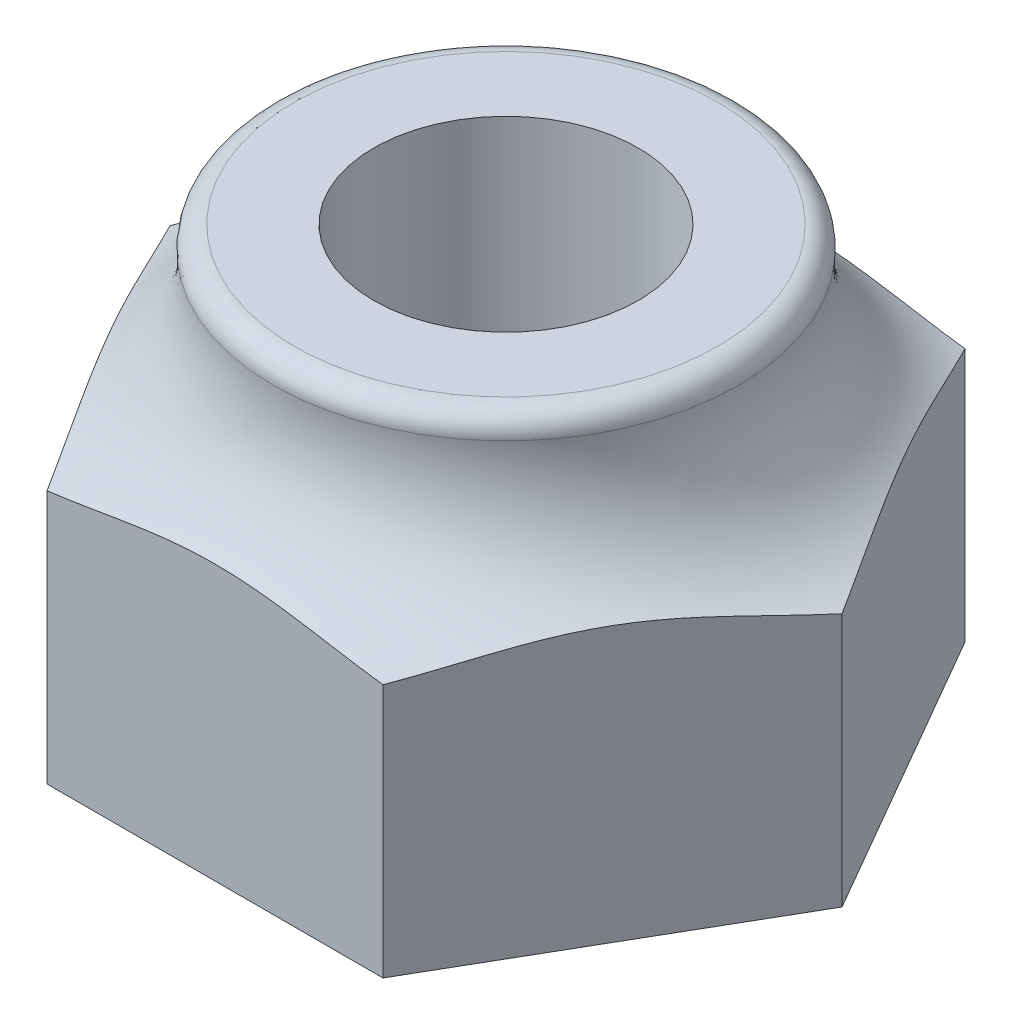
from build123d import *

# Parameters (mm, degrees)
AUFSATZ_LINEAR_AUSTRAGEN1_DEPTH = 4
F_1_0_1_DURCHMESSER_BOHRUNG1_D  = 2.5


with BuildPart() as part:
    # Skizze1 → Aufsatz-Linear austragen1 (new body)
    with BuildSketch(Plane(origin=(0, 0, 0), x_dir=(1, 0, 0), z_dir=(0, 1, 0))):
        Polygon((1.58771324, 2.75), (-1.58771324, 2.75), (-3.175426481, 0), (-1.58771324, -2.75), (1.58771324, -2.75), (3.175426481, 0), align=None)
    extrude(amount=AUFSATZ_LINEAR_AUSTRAGEN1_DEPTH)

    # Skizze2 → Schnitt-Rotation1 (revolve, cut)
    with BuildSketch(Plane.XY, mode=Mode.PRIVATE) as schnitt_rotation1_sk:
        with BuildLine():
            Line((-2, 4), (-3.175426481, 4))
            Line((-3.175426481, 4), (-3.175426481, 2.4))
            ThreePointArc((-3.175426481, 2.4), (-2.431870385, 2.91019046), (-2.199133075, 3.781398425))
            ThreePointArc((-2.199133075, 3.781398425), (-2.147851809, 3.934684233), (-2, 4))
        make_face()
    revolve(schnitt_rotation1_sk.sketch.rotate(Axis((0, 0, 0), (0, 1, 0)), 270), axis=Axis((0, 0, 0), (0, 1, 0)), mode=Mode.SUBTRACT)

    # 1.0 _1_ Durchmesser Bohrung1 (through all)
    with Locations(Plane(origin=(0, 4, 0), x_dir=(1, 0, 0), z_dir=(0, 1, 0))):
        with Locations((0, 0)):
            Hole(F_1_0_1_DURCHMESSER_BOHRUNG1_D / 2)


solid = part.part
